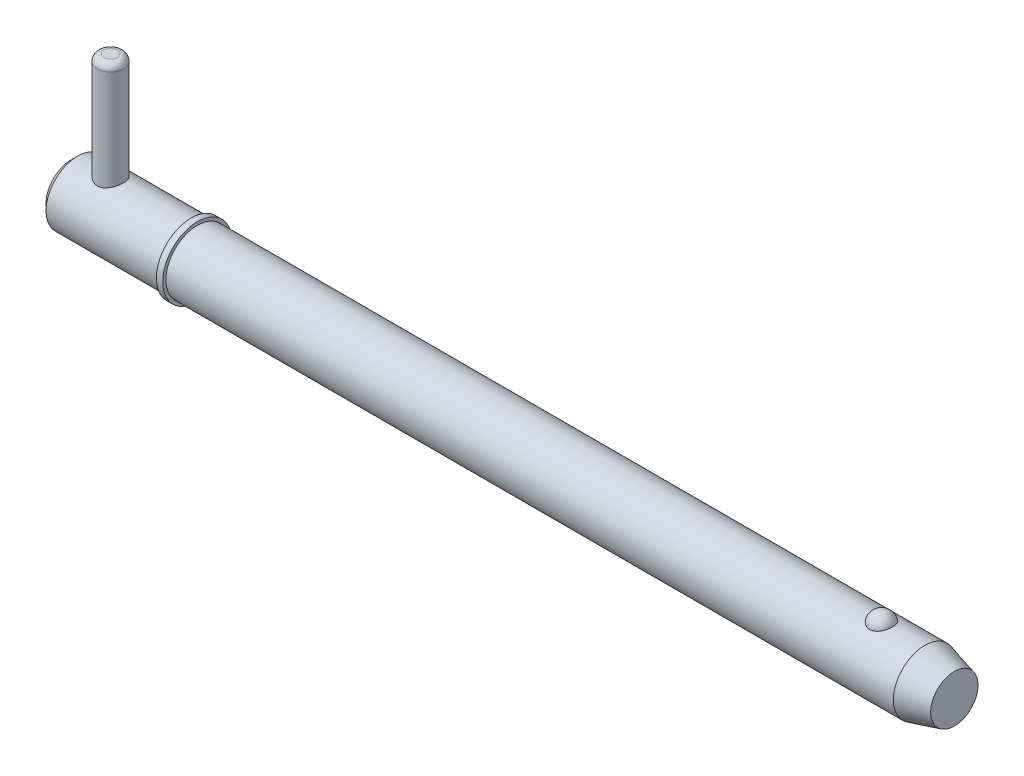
ISO-10303-21;
HEADER;
FILE_DESCRIPTION(('STEP AP214'),'2;1');
FILE_NAME('part.step','',(''),(''),'','','');
FILE_SCHEMA(('AUTOMOTIVE_DESIGN { 1 0 10303 214 1 1 1 1 }'));
ENDSEC;
DATA;
#1=APPLICATION_CONTEXT('core data for automotive mechanical design processes');
#2=APPLICATION_PROTOCOL_DEFINITION('international standard','automotive_design',2000,#1);
#3=PRODUCT_CONTEXT('',#1,'mechanical');
#4=PRODUCT('Part','Part','',(#3));
#5=PRODUCT_RELATED_PRODUCT_CATEGORY('part','',(#4));
#6=PRODUCT_DEFINITION_FORMATION('','',#4);
#7=PRODUCT_DEFINITION_CONTEXT('part definition',#1,'design');
#8=PRODUCT_DEFINITION('design','',#6,#7);
#9=PRODUCT_DEFINITION_SHAPE('','',#8);
#10=(LENGTH_UNIT() NAMED_UNIT(*) SI_UNIT(.MILLI.,.METRE.));
#11=(NAMED_UNIT(*) PLANE_ANGLE_UNIT() SI_UNIT($,.RADIAN.));
#12=(NAMED_UNIT(*) SI_UNIT($,.STERADIAN.) SOLID_ANGLE_UNIT());
#13=UNCERTAINTY_MEASURE_WITH_UNIT(LENGTH_MEASURE(1.E-05),#10,'distance_accuracy_value','');
#14=(GEOMETRIC_REPRESENTATION_CONTEXT(3) GLOBAL_UNCERTAINTY_ASSIGNED_CONTEXT((#13)) GLOBAL_UNIT_ASSIGNED_CONTEXT((#10,
#11,#12)) REPRESENTATION_CONTEXT('',''));
#15=CARTESIAN_POINT('',(0.,0.,0.));
#16=DIRECTION('',(0.,0.,1.));
#17=DIRECTION('',(1.,0.,0.));
#18=AXIS2_PLACEMENT_3D('',#15,#16,#17);
#19=CARTESIAN_POINT('',(5.94,20.635,0.));
#20=DIRECTION('',(0.,-1.,0.));
#21=DIRECTION('',(0.,0.,-1.));
#22=AXIS2_PLACEMENT_3D('',#19,#20,#21);
#23=CYLINDRICAL_SURFACE('',#22,1.98);
#24=CARTESIAN_POINT('',(5.94,-3.775,0.));
#25=DIRECTION('',(0.,1.,0.));
#26=DIRECTION('',(0.,0.,1.));
#27=AXIS2_PLACEMENT_3D('',#24,#25,#26);
#28=CIRCLE('',#27,1.98);
#29=CARTESIAN_POINT('',(5.94,-3.775,1.98));
#30=VERTEX_POINT('',#29);
#31=EDGE_CURVE('P0_E25',#30,#30,#28,.T.);
#32=ORIENTED_EDGE('',*,*,#31,.T.);
#33=EDGE_LOOP('',(#32));
#34=FACE_BOUND('',#33,.T.);
#35=CARTESIAN_POINT('',(5.94,19.645,0.));
#36=DIRECTION('',(0.,1.,0.));
#37=DIRECTION('',(0.,0.,1.));
#38=AXIS2_PLACEMENT_3D('',#35,#36,#37);
#39=CIRCLE('',#38,1.98);
#40=CARTESIAN_POINT('',(5.94,19.645,1.98));
#41=VERTEX_POINT('',#40);
#42=EDGE_CURVE('P0_E29',#41,#41,#39,.F.);
#43=ORIENTED_EDGE('',*,*,#42,.T.);
#44=EDGE_LOOP('',(#43));
#45=FACE_BOUND('',#44,.T.);
#46=ADVANCED_FACE('P0_F14',(#34,#45),#23,.T.);
#47=CARTESIAN_POINT('',(5.94,20.635,0.));
#48=DIRECTION('',(0.,1.,0.));
#49=DIRECTION('',(0.,0.,1.));
#50=AXIS2_PLACEMENT_3D('',#47,#48,#49);
#51=PLANE('',#50);
#52=CARTESIAN_POINT('',(5.94,20.635,0.));
#53=DIRECTION('',(0.,1.,0.));
#54=DIRECTION('',(0.,0.,1.));
#55=AXIS2_PLACEMENT_3D('',#52,#53,#54);
#56=CIRCLE('',#55,0.99);
#57=CARTESIAN_POINT('',(5.94,20.635,0.99));
#58=VERTEX_POINT('',#57);
#59=EDGE_CURVE('P0_E10',#58,#58,#56,.T.);
#60=ORIENTED_EDGE('',*,*,#59,.T.);
#61=EDGE_LOOP('',(#60));
#62=FACE_BOUND('',#61,.T.);
#63=ADVANCED_FACE('P0_F46',(#62),#51,.T.);
#64=CARTESIAN_POINT('',(5.94,-4.765,0.));
#65=DIRECTION('',(0.,1.,0.));
#66=DIRECTION('',(0.,0.,1.));
#67=AXIS2_PLACEMENT_3D('',#64,#65,#66);
#68=PLANE('',#67);
#69=CARTESIAN_POINT('',(5.94,-4.765,0.));
#70=DIRECTION('',(0.,1.,0.));
#71=DIRECTION('',(0.,0.,1.));
#72=AXIS2_PLACEMENT_3D('',#69,#70,#71);
#73=CIRCLE('',#72,0.99);
#74=CARTESIAN_POINT('',(5.94,-4.765,0.99));
#75=VERTEX_POINT('',#74);
#76=EDGE_CURVE('P0_E21',#75,#75,#73,.F.);
#77=ORIENTED_EDGE('',*,*,#76,.T.);
#78=EDGE_LOOP('',(#77));
#79=FACE_BOUND('',#78,.T.);
#80=ADVANCED_FACE('P0_F43',(#79),#68,.F.);
#81=CARTESIAN_POINT('',(5.94,-3.775,0.));
#82=DIRECTION('',(0.,1.,0.));
#83=DIRECTION('',(0.,0.,1.));
#84=AXIS2_PLACEMENT_3D('',#81,#82,#83);
#85=DEGENERATE_TOROIDAL_SURFACE('',#84,0.99,0.99,.T.);
#86=ORIENTED_EDGE('',*,*,#76,.F.);
#87=EDGE_LOOP('',(#86));
#88=FACE_BOUND('',#87,.T.);
#89=ORIENTED_EDGE('',*,*,#31,.F.);
#90=EDGE_LOOP('',(#89));
#91=FACE_BOUND('',#90,.T.);
#92=ADVANCED_FACE('P0_F38',(#88,#91),#85,.T.);
#93=CARTESIAN_POINT('',(5.94,19.645,0.));
#94=DIRECTION('',(0.,1.,0.));
#95=DIRECTION('',(0.,0.,1.));
#96=AXIS2_PLACEMENT_3D('',#93,#94,#95);
#97=DEGENERATE_TOROIDAL_SURFACE('',#96,0.99,0.99,.T.);
#98=ORIENTED_EDGE('',*,*,#42,.F.);
#99=EDGE_LOOP('',(#98));
#100=FACE_BOUND('',#99,.T.);
#101=ORIENTED_EDGE('',*,*,#59,.F.);
#102=EDGE_LOOP('',(#101));
#103=FACE_BOUND('',#102,.T.);
#104=ADVANCED_FACE('P0_F16',(#100,#103),#97,.T.);
#105=CLOSED_SHELL('',(#46,#63,#80,#92,#104));
#106=MANIFOLD_SOLID_BREP('P0_B1',#105);
#107=CARTESIAN_POINT('',(0.,0.,0.));
#108=DIRECTION('',(1.,0.,0.));
#109=DIRECTION('',(0.,0.,-1.));
#110=AXIS2_PLACEMENT_3D('',#107,#108,#109);
#111=CYLINDRICAL_SURFACE('',#110,4.765);
#112=CARTESIAN_POINT('',(128.904194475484,0.,0.));
#113=DIRECTION('',(1.,0.,0.));
#114=DIRECTION('',(0.,0.,-1.));
#115=AXIS2_PLACEMENT_3D('',#112,#113,#114);
#116=CIRCLE('',#115,4.765);
#117=CARTESIAN_POINT('',(128.904194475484,0.,-4.765));
#118=VERTEX_POINT('',#117);
#119=EDGE_CURVE('P1_E81',#118,#118,#116,.T.);
#120=ORIENTED_EDGE('',*,*,#119,.F.);
#121=EDGE_LOOP('',(#120));
#122=FACE_BOUND('',#121,.T.);
#123=CARTESIAN_POINT('',(19.05,0.,0.));
#124=DIRECTION('',(1.,0.,0.));
#125=DIRECTION('',(0.,0.,-1.));
#126=AXIS2_PLACEMENT_3D('',#123,#124,#125);
#127=CIRCLE('',#126,4.765);
#128=CARTESIAN_POINT('',(19.05,0.,-4.765));
#129=VERTEX_POINT('',#128);
#130=EDGE_CURVE('P1_E85',#129,#129,#127,.T.);
#131=ORIENTED_EDGE('',*,*,#130,.T.);
#132=EDGE_LOOP('',(#131));
#133=FACE_BOUND('',#132,.T.);
#134=CARTESIAN_POINT('',(122.351020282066,4.42764777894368,1.76101111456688));
#135=CARTESIAN_POINT('',(122.259721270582,4.42764470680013,1.76101422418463));
#136=CARTESIAN_POINT('',(122.168446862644,4.43059091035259,1.75366340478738));
#137=CARTESIAN_POINT('',(121.988615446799,4.44201846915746,1.72451180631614));
#138=CARTESIAN_POINT('',(121.900057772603,4.45049845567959,1.70271460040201));
#139=CARTESIAN_POINT('',(121.728257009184,4.47200516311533,1.6453937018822));
#140=CARTESIAN_POINT('',(121.645006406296,4.48502527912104,1.60988994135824));
#141=CARTESIAN_POINT('',(121.485763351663,4.51419542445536,1.52617873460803));
#142=CARTESIAN_POINT('',(121.409772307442,4.53034605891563,1.47796883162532));
#143=CARTESIAN_POINT('',(121.264744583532,4.5645931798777,1.36860494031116));
#144=CARTESIAN_POINT('',(121.195964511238,4.58273170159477,1.30712420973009));
#145=CARTESIAN_POINT('',(121.069342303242,4.61870302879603,1.17370204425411));
#146=CARTESIAN_POINT('',(121.011502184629,4.63653577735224,1.10175868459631));
#147=CARTESIAN_POINT('',(120.905570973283,4.67090140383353,0.945806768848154));
#148=CARTESIAN_POINT('',(120.858030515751,4.68734068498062,0.861402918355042));
#149=CARTESIAN_POINT('',(120.777081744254,4.71628466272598,0.685442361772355));
#150=CARTESIAN_POINT('',(120.743674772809,4.72878898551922,0.593884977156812));
#151=CARTESIAN_POINT('',(120.691287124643,4.74874061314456,0.404781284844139));
#152=CARTESIAN_POINT('',(120.672517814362,4.75611366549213,0.30716844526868));
#153=CARTESIAN_POINT('',(120.650584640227,4.76475393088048,0.109940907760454));
#154=CARTESIAN_POINT('',(120.647420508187,4.76602124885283,0.0103262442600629));
#155=CARTESIAN_POINT('',(120.656740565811,4.76232928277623,-0.187629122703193));
#156=CARTESIAN_POINT('',(120.669158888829,4.7573962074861,-0.285973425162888));
#157=CARTESIAN_POINT('',(120.709280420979,4.74184975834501,-0.479027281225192));
#158=CARTESIAN_POINT('',(120.736983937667,4.7312362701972,-0.573736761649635));
#159=CARTESIAN_POINT('',(120.807158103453,4.70540026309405,-0.756973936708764));
#160=CARTESIAN_POINT('',(120.849646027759,4.69017235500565,-0.845494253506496));
#161=CARTESIAN_POINT('',(120.948520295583,4.6566986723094,-1.01378033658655));
#162=CARTESIAN_POINT('',(121.004907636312,4.63845268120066,-1.09354547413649));
#163=CARTESIAN_POINT('',(121.130552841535,4.60085438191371,-1.24228523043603));
#164=CARTESIAN_POINT('',(121.199843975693,4.58149930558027,-1.31123108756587));
#165=CARTESIAN_POINT('',(121.349606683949,4.54391653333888,-1.43607409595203));
#166=CARTESIAN_POINT('',(121.430077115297,4.52568872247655,-1.49197257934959));
#167=CARTESIAN_POINT('',(121.598150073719,4.49293007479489,-1.58786764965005));
#168=CARTESIAN_POINT('',(121.685544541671,4.47832346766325,-1.62820219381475));
#169=CARTESIAN_POINT('',(121.866553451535,4.45406011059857,-1.69345757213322));
#170=CARTESIAN_POINT('',(121.96016555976,4.44440151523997,-1.71838415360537));
#171=CARTESIAN_POINT('',(122.145893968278,4.43159888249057,-1.75112843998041));
#172=CARTESIAN_POINT('',(122.237849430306,4.42815213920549,-1.75974223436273));
#173=CARTESIAN_POINT('',(122.421965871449,4.427247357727,-1.76201865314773));
#174=CARTESIAN_POINT('',(122.514126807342,4.42978816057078,-1.7556841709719));
#175=CARTESIAN_POINT('',(122.693129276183,4.4403864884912,-1.72869560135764));
#176=CARTESIAN_POINT('',(122.780047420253,4.44827555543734,-1.70847853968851));
#177=CARTESIAN_POINT('',(122.949131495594,4.46852246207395,-1.65479562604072));
#178=CARTESIAN_POINT('',(123.031297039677,4.48088066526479,-1.62132869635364));
#179=CARTESIAN_POINT('',(123.190591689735,4.50907357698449,-1.54120560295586));
#180=CARTESIAN_POINT('',(123.267570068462,4.52497884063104,-1.49427526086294));
#181=CARTESIAN_POINT('',(123.412708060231,4.55845148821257,-1.38881222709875));
#182=CARTESIAN_POINT('',(123.480865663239,4.57601924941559,-1.33027689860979));
#183=CARTESIAN_POINT('',(123.610099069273,4.61196537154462,-1.19991049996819));
#184=CARTESIAN_POINT('',(123.670656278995,4.63034074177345,-1.12756415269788));
#185=CARTESIAN_POINT('',(123.779279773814,4.66513959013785,-0.973612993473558));
#186=CARTESIAN_POINT('',(123.827343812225,4.68156271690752,-0.892006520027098));
#187=CARTESIAN_POINT('',(123.911383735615,4.71130224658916,-0.718892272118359));
#188=CARTESIAN_POINT('',(123.946918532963,4.724501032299,-0.627149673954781));
#189=CARTESIAN_POINT('',(124.002952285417,4.74571823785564,-0.438611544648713));
#190=CARTESIAN_POINT('',(124.023450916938,4.75373654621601,-0.341815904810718));
#191=CARTESIAN_POINT('',(124.049033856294,4.76378905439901,-0.145633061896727));
#192=CARTESIAN_POINT('',(124.054076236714,4.76580697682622,-0.046239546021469));
#193=CARTESIAN_POINT('',(124.048523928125,4.7636057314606,0.152038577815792));
#194=CARTESIAN_POINT('',(124.037929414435,4.75938663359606,0.250923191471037));
#195=CARTESIAN_POINT('',(124.001387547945,4.74516937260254,0.445004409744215));
#196=CARTESIAN_POINT('',(123.975496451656,4.73519238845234,0.54021317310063));
#197=CARTESIAN_POINT('',(123.908927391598,4.71049394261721,0.724662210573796));
#198=CARTESIAN_POINT('',(123.868248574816,4.69577220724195,0.81390214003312));
#199=CARTESIAN_POINT('',(123.772717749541,4.66303767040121,0.984313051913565));
#200=CARTESIAN_POINT('',(123.717804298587,4.64501070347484,1.06544688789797));
#201=CARTESIAN_POINT('',(123.595049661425,4.60764678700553,1.21692673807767));
#202=CARTESIAN_POINT('',(123.527208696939,4.58830985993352,1.2872729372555));
#203=CARTESIAN_POINT('',(123.380548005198,4.55060370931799,1.41479271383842));
#204=CARTESIAN_POINT('',(123.301791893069,4.53222967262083,1.47203785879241));
#205=CARTESIAN_POINT('',(123.134989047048,4.49849576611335,1.57212016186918));
#206=CARTESIAN_POINT('',(123.046941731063,4.48313608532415,1.61495641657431));
#207=CARTESIAN_POINT('',(122.859791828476,4.45676184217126,1.68642657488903));
#208=CARTESIAN_POINT('',(122.760365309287,4.44598302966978,1.71430590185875));
#209=CARTESIAN_POINT('',(122.557621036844,4.43142918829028,1.75159258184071));
#210=CARTESIAN_POINT('',(122.454304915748,4.42765125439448,1.76100759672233));
#211=CARTESIAN_POINT('',(122.351020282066,4.42764777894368,1.76101111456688));
#212=B_SPLINE_CURVE_WITH_KNOTS('',3,(#134,#135,#136,#137,#138,#139,#140,#141,#142,#143,#144,
#145,#146,#147,#148,#149,#150,#151,#152,#153,#154,#155,#156,#157,#158,#159,#160,#161,#162,#163,
#164,#165,#166,#167,#168,#169,#170,#171,#172,#173,#174,#175,#176,#177,#178,#179,#180,#181,#182,
#183,#184,#185,#186,#187,#188,#189,#190,#191,#192,#193,#194,#195,#196,#197,#198,#199,#200,#201,
#202,#203,#204,#205,#206,#207,#208,#209,#210,#211),.UNSPECIFIED.,.T.,.F.,(4,2,2,2,2,2,2,2,2,2,2,
2,2,2,2,2,2,2,2,2,2,2,2,2,2,2,2,2,2,2,2,2,2,2,2,2,2,2,4),(0.,0.273517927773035,
0.546968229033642,0.820022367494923,1.09312934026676,1.37393946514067,1.65480131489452,
1.94820420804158,2.24163496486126,2.53922817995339,2.8368162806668,3.13315071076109,
3.42949110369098,3.72617893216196,4.02288805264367,4.32037303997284,4.61782764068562,
4.90840095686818,5.19886582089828,5.4747485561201,5.75057789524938,6.01809977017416,
6.2856434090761,6.55907787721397,6.83257454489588,7.11962987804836,7.40673679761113,
7.70312663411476,7.99952284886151,8.29672237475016,8.59391856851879,8.89002850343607,
9.18615552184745,9.483582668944,9.78100471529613,10.0767610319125,10.3725358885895,
10.6820893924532,10.991514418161),.UNSPECIFIED.);
#213=CARTESIAN_POINT('',(122.351020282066,4.42764777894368,1.76101111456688));
#214=VERTEX_POINT('',#213);
#215=EDGE_CURVE('P1_E35',#214,#214,#212,.T.);
#216=ORIENTED_EDGE('',*,*,#215,.T.);
#217=EDGE_LOOP('',(#216));
#218=FACE_BOUND('',#217,.T.);
#219=ADVANCED_FACE('P1_F13',(#122,#133,#218),#111,.T.);
#220=CARTESIAN_POINT('',(0.,0.,0.));
#221=DIRECTION('',(-1.,0.,0.));
#222=DIRECTION('',(0.,0.,1.));
#223=AXIS2_PLACEMENT_3D('',#220,#221,#222);
#224=PLANE('',#223);
#225=CARTESIAN_POINT('',(0.,0.,0.));
#226=DIRECTION('',(1.,0.,0.));
#227=DIRECTION('',(0.,0.,-1.));
#228=AXIS2_PLACEMENT_3D('',#225,#226,#227);
#229=CIRCLE('',#228,3.812);
#230=CARTESIAN_POINT('',(0.,0.,-3.812));
#231=VERTEX_POINT('',#230);
#232=EDGE_CURVE('P1_E9',#231,#231,#229,.T.);
#233=ORIENTED_EDGE('',*,*,#232,.F.);
#234=EDGE_LOOP('',(#233));
#235=FACE_BOUND('',#234,.T.);
#236=ADVANCED_FACE('P1_F15',(#235),#224,.T.);
#237=CARTESIAN_POINT('',(0.952999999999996,0.,0.));
#238=DIRECTION('',(1.,0.,0.));
#239=DIRECTION('',(0.,0.,-1.));
#240=AXIS2_PLACEMENT_3D('',#237,#238,#239);
#241=CONICAL_SURFACE('',#240,4.765,0.78539816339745);
#242=ORIENTED_EDGE('',*,*,#232,.T.);
#243=EDGE_LOOP('',(#242));
#244=FACE_BOUND('',#243,.T.);
#245=CARTESIAN_POINT('',(0.952999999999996,0.,0.));
#246=DIRECTION('',(1.,0.,0.));
#247=DIRECTION('',(0.,0.,-1.));
#248=AXIS2_PLACEMENT_3D('',#245,#246,#247);
#249=CIRCLE('',#248,4.765);
#250=CARTESIAN_POINT('',(0.952999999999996,0.,-4.765));
#251=VERTEX_POINT('',#250);
#252=EDGE_CURVE('P1_E26',#251,#251,#249,.T.);
#253=ORIENTED_EDGE('',*,*,#252,.F.);
#254=EDGE_LOOP('',(#253));
#255=FACE_BOUND('',#254,.T.);
#256=ADVANCED_FACE('P1_F77',(#244,#255),#241,.T.);
#257=CARTESIAN_POINT('',(0.,0.,0.));
#258=DIRECTION('',(1.,0.,0.));
#259=DIRECTION('',(0.,0.,-1.));
#260=AXIS2_PLACEMENT_3D('',#257,#258,#259);
#261=CYLINDRICAL_SURFACE('',#260,4.765);
#262=CARTESIAN_POINT('',(5.94,-4.33414639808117,1.98));
#263=CARTESIAN_POINT('',(5.83435484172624,-4.33415447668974,1.97999169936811));
#264=CARTESIAN_POINT('',(5.72854887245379,-4.33806396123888,1.97149330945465));
#265=CARTESIAN_POINT('',(5.51998191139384,-4.35319906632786,1.93783487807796));
#266=CARTESIAN_POINT('',(5.41723000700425,-4.3644446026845,1.91262947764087));
#267=CARTESIAN_POINT('',(5.21817294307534,-4.39274225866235,1.84670269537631));
#268=CARTESIAN_POINT('',(5.12184344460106,-4.40977076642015,1.80604432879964));
#269=CARTESIAN_POINT('',(4.93740039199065,-4.44768106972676,1.71055160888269));
#270=CARTESIAN_POINT('',(4.84928487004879,-4.46856193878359,1.65572066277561));
#271=CARTESIAN_POINT('',(4.67826533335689,-4.51326966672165,1.52981120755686));
#272=CARTESIAN_POINT('',(4.59593118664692,-4.53719608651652,1.45799365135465));
#273=CARTESIAN_POINT('',(4.44405452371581,-4.58448035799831,1.30170177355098));
#274=CARTESIAN_POINT('',(4.37451692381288,-4.60783798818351,1.21722260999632));
#275=CARTESIAN_POINT('',(4.24730683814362,-4.65256187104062,1.03353484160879));
#276=CARTESIAN_POINT('',(4.19027484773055,-4.67379892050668,0.933848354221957));
#277=CARTESIAN_POINT('',(4.0940363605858,-4.7106711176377,0.7252544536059));
#278=CARTESIAN_POINT('',(4.05482199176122,-4.72630873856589,0.61635113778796));
#279=CARTESIAN_POINT('',(3.99739515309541,-4.74951416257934,0.398397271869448));
#280=CARTESIAN_POINT('',(3.97820018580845,-4.7574579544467,0.289646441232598));
#281=CARTESIAN_POINT('',(3.95818309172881,-4.76574596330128,0.0701967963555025));
#282=CARTESIAN_POINT('',(3.95735355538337,-4.76609324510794,-0.0405012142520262));
#283=CARTESIAN_POINT('',(3.9735743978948,-4.75937098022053,-0.253561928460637));
#284=CARTESIAN_POINT('',(3.98954548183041,-4.75274912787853,-0.356023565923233));
#285=CARTESIAN_POINT('',(4.03706504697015,-4.73344665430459,-0.556659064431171));
#286=CARTESIAN_POINT('',(4.06861467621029,-4.72076558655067,-0.654832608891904));
#287=CARTESIAN_POINT('',(4.14677192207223,-4.69032846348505,-0.845904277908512));
#288=CARTESIAN_POINT('',(4.19360181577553,-4.67249797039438,-0.938699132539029));
#289=CARTESIAN_POINT('',(4.30077315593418,-4.63350852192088,-1.11535616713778));
#290=CARTESIAN_POINT('',(4.3611193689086,-4.61234839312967,-1.19921518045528));
#291=CARTESIAN_POINT('',(4.49853487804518,-4.56707259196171,-1.3618711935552));
#292=CARTESIAN_POINT('',(4.57648039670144,-4.5428537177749,-1.43990029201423));
#293=CARTESIAN_POINT('',(4.74440779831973,-4.49530722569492,-1.58211009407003));
#294=CARTESIAN_POINT('',(4.83439425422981,-4.47197995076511,-1.64628551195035));
#295=CARTESIAN_POINT('',(5.02755026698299,-4.42812342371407,-1.76092221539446));
#296=CARTESIAN_POINT('',(5.13105348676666,-4.40770990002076,-1.81086937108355));
#297=CARTESIAN_POINT('',(5.34607555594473,-4.37336901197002,-1.89231211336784));
#298=CARTESIAN_POINT('',(5.45758864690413,-4.3594370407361,-1.92382080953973));
#299=CARTESIAN_POINT('',(5.67777275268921,-4.34077746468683,-1.96554536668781));
#300=CARTESIAN_POINT('',(5.78616167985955,-4.33551319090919,-1.9770057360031));
#301=CARTESIAN_POINT('',(6.00341835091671,-4.33325118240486,-1.98196183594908));
#302=CARTESIAN_POINT('',(6.11228591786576,-4.33625061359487,-1.97546372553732));
#303=CARTESIAN_POINT('',(6.32012423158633,-4.34962383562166,-1.94582288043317));
#304=CARTESIAN_POINT('',(6.41928436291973,-4.35951709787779,-1.92376364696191));
#305=CARTESIAN_POINT('',(6.61241543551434,-4.38495043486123,-1.86506038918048));
#306=CARTESIAN_POINT('',(6.70638516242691,-4.40049182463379,-1.82841296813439));
#307=CARTESIAN_POINT('',(6.89090272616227,-4.43627016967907,-1.73985559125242));
#308=CARTESIAN_POINT('',(6.98113841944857,-4.45667771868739,-1.68736639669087));
#309=CARTESIAN_POINT('',(7.1519532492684,-4.49964530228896,-1.56919282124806));
#310=CARTESIAN_POINT('',(7.232528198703,-4.52220626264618,-1.50350275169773));
#311=CARTESIAN_POINT('',(7.38851617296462,-4.56914071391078,-1.35452895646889));
#312=CARTESIAN_POINT('',(7.46298462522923,-4.5935132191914,-1.27025197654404));
#313=CARTESIAN_POINT('',(7.59689029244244,-4.63962841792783,-1.08983181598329));
#314=CARTESIAN_POINT('',(7.65632644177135,-4.66137092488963,-0.993687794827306));
#315=CARTESIAN_POINT('',(7.75840361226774,-4.69991192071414,-0.791608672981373));
#316=CARTESIAN_POINT('',(7.80100481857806,-4.71669866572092,-0.685651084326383));
#317=CARTESIAN_POINT('',(7.86746997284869,-4.74331408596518,-0.467197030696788));
#318=CARTESIAN_POINT('',(7.8913450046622,-4.75314687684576,-0.354704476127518));
#319=CARTESIAN_POINT('',(7.91828971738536,-4.76427543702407,-0.134819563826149));
#320=CARTESIAN_POINT('',(7.92269147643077,-4.76611762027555,-0.027616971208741));
#321=CARTESIAN_POINT('',(7.91414154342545,-4.76256684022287,0.185959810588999));
#322=CARTESIAN_POINT('',(7.90119286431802,-4.75717513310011,0.292334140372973));
#323=CARTESIAN_POINT('',(7.85926572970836,-4.74004856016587,0.497383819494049));
#324=CARTESIAN_POINT('',(7.83086647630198,-4.72854322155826,0.596198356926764));
#325=CARTESIAN_POINT('',(7.75947503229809,-4.70045111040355,0.787624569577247));
#326=CARTESIAN_POINT('',(7.71648006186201,-4.68386336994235,0.880235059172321));
#327=CARTESIAN_POINT('',(7.6149456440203,-4.64628321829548,1.06122875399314));
#328=CARTESIAN_POINT('',(7.55579211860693,-4.62512577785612,1.14923242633));
#329=CARTESIAN_POINT('',(7.42451813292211,-4.58091700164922,1.31443888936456));
#330=CARTESIAN_POINT('',(7.35239289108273,-4.5578649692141,1.39163767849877));
#331=CARTESIAN_POINT('',(7.19146107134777,-4.51050832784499,1.53847013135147));
#332=CARTESIAN_POINT('',(7.10185635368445,-4.48622440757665,1.60723941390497));
#333=CARTESIAN_POINT('',(6.91164948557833,-4.44076541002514,1.72888900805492));
#334=CARTESIAN_POINT('',(6.81104124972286,-4.41959206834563,1.78176046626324));
#335=CARTESIAN_POINT('',(6.60181953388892,-4.38318936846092,1.86953227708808));
#336=CARTESIAN_POINT('',(6.49325511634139,-4.3679267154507,1.90453365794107));
#337=CARTESIAN_POINT('',(6.32681512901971,-4.35102038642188,1.94268459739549));
#338=CARTESIAN_POINT('',(6.27079191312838,-4.34638447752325,1.953006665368));
#339=CARTESIAN_POINT('',(6.15793999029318,-4.33925923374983,1.96879053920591));
#340=CARTESIAN_POINT('',(6.10111188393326,-4.33676837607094,1.97425579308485));
#341=CARTESIAN_POINT('',(6.00947316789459,-4.33456308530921,1.97908711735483));
#342=CARTESIAN_POINT('',(5.97474528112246,-4.33414374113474,1.98000272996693));
#343=CARTESIAN_POINT('',(5.94,-4.33414639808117,1.98));
#344=B_SPLINE_CURVE_WITH_KNOTS('',3,(#262,#263,#264,#265,#266,#267,#268,#269,#270,#271,#272,
#273,#274,#275,#276,#277,#278,#279,#280,#281,#282,#283,#284,#285,#286,#287,#288,#289,#290,#291,
#292,#293,#294,#295,#296,#297,#298,#299,#300,#301,#302,#303,#304,#305,#306,#307,#308,#309,#310,
#311,#312,#313,#314,#315,#316,#317,#318,#319,#320,#321,#322,#323,#324,#325,#326,#327,#328,#329,
#330,#331,#332,#333,#334,#335,#336,#337,#338,#339,#340,#341,#342,#343),.UNSPECIFIED.,.T.,.F.,(4,
2,2,2,2,2,2,2,2,2,2,2,2,2,2,2,2,2,2,2,2,2,2,2,2,2,2,2,2,2,2,2,2,2,2,2,2,2,2,2,4),(0.,
0.316814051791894,0.634491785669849,0.950887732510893,1.2672076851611,1.60127705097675,
1.93547449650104,2.28407463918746,2.63252061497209,2.96292077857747,3.29318763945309,
3.60346227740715,3.91375978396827,4.22878888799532,4.54392926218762,4.88117914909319,
5.21855748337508,5.56691259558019,5.91501972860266,6.24062939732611,6.56612741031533,
6.87094948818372,7.17584258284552,7.49361276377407,7.81152017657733,8.15513975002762,
8.4987836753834,8.8432355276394,9.18748334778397,9.50777781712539,9.8280166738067,
10.1370037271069,10.4460496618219,10.7690461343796,11.0921619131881,11.4371238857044,
11.7822776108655,12.1254577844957,12.2967183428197,12.4678572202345,12.5720531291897),.UNSPECIFIED.);
#345=CARTESIAN_POINT('',(5.94,-4.33414639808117,1.98));
#346=VERTEX_POINT('',#345);
#347=EDGE_CURVE('P1_E17',#346,#346,#344,.T.);
#348=ORIENTED_EDGE('',*,*,#347,.F.);
#349=EDGE_LOOP('',(#348));
#350=FACE_BOUND('',#349,.T.);
#351=CARTESIAN_POINT('',(5.94,4.33414639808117,1.98));
#352=CARTESIAN_POINT('',(6.04564515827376,4.33415447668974,1.97999169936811));
#353=CARTESIAN_POINT('',(6.15145112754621,4.33806396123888,1.97149330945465));
#354=CARTESIAN_POINT('',(6.36001808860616,4.35319906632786,1.93783487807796));
#355=CARTESIAN_POINT('',(6.46276999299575,4.3644446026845,1.91262947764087));
#356=CARTESIAN_POINT('',(6.66182705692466,4.39274225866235,1.84670269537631));
#357=CARTESIAN_POINT('',(6.75815655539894,4.40977076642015,1.80604432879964));
#358=CARTESIAN_POINT('',(6.94259960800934,4.44768106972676,1.71055160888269));
#359=CARTESIAN_POINT('',(7.03071512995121,4.46856193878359,1.65572066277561));
#360=CARTESIAN_POINT('',(7.20173466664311,4.51326966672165,1.52981120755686));
#361=CARTESIAN_POINT('',(7.28406881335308,4.53719608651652,1.45799365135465));
#362=CARTESIAN_POINT('',(7.43594547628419,4.58448035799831,1.30170177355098));
#363=CARTESIAN_POINT('',(7.50548307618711,4.60783798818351,1.21722260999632));
#364=CARTESIAN_POINT('',(7.63269316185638,4.65256187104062,1.03353484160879));
#365=CARTESIAN_POINT('',(7.68972515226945,4.67379892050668,0.933848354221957));
#366=CARTESIAN_POINT('',(7.7859636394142,4.7106711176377,0.7252544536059));
#367=CARTESIAN_POINT('',(7.82517800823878,4.72630873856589,0.61635113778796));
#368=CARTESIAN_POINT('',(7.88260484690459,4.74951416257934,0.398397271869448));
#369=CARTESIAN_POINT('',(7.90179981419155,4.7574579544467,0.289646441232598));
#370=CARTESIAN_POINT('',(7.92181690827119,4.76574596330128,0.0701967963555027));
#371=CARTESIAN_POINT('',(7.92264644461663,4.76609324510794,-0.040501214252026));
#372=CARTESIAN_POINT('',(7.9064256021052,4.75937098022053,-0.253561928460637));
#373=CARTESIAN_POINT('',(7.89045451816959,4.75274912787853,-0.356023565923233));
#374=CARTESIAN_POINT('',(7.84293495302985,4.73344665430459,-0.55665906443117));
#375=CARTESIAN_POINT('',(7.81138532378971,4.72076558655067,-0.654832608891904));
#376=CARTESIAN_POINT('',(7.73322807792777,4.69032846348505,-0.845904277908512));
#377=CARTESIAN_POINT('',(7.68639818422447,4.67249797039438,-0.938699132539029));
#378=CARTESIAN_POINT('',(7.57922684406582,4.63350852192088,-1.11535616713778));
#379=CARTESIAN_POINT('',(7.5188806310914,4.61234839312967,-1.19921518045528));
#380=CARTESIAN_POINT('',(7.38146512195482,4.56707259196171,-1.3618711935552));
#381=CARTESIAN_POINT('',(7.30351960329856,4.5428537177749,-1.43990029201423));
#382=CARTESIAN_POINT('',(7.13559220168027,4.49530722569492,-1.58211009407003));
#383=CARTESIAN_POINT('',(7.04560574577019,4.47197995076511,-1.64628551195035));
#384=CARTESIAN_POINT('',(6.85244973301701,4.42812342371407,-1.76092221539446));
#385=CARTESIAN_POINT('',(6.74894651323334,4.40770990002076,-1.81086937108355));
#386=CARTESIAN_POINT('',(6.53392444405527,4.37336901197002,-1.89231211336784));
#387=CARTESIAN_POINT('',(6.42241135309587,4.3594370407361,-1.92382080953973));
#388=CARTESIAN_POINT('',(6.20222724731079,4.34077746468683,-1.96554536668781));
#389=CARTESIAN_POINT('',(6.09383832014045,4.33551319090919,-1.9770057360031));
#390=CARTESIAN_POINT('',(5.87658164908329,4.33325118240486,-1.98196183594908));
#391=CARTESIAN_POINT('',(5.76771408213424,4.33625061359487,-1.97546372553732));
#392=CARTESIAN_POINT('',(5.55987576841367,4.34962383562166,-1.94582288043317));
#393=CARTESIAN_POINT('',(5.46071563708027,4.35951709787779,-1.92376364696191));
#394=CARTESIAN_POINT('',(5.26758456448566,4.38495043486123,-1.86506038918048));
#395=CARTESIAN_POINT('',(5.17361483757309,4.40049182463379,-1.82841296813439));
#396=CARTESIAN_POINT('',(4.98909727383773,4.43627016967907,-1.73985559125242));
#397=CARTESIAN_POINT('',(4.89886158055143,4.45667771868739,-1.68736639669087));
#398=CARTESIAN_POINT('',(4.72804675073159,4.49964530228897,-1.56919282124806));
#399=CARTESIAN_POINT('',(4.647471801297,4.52220626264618,-1.50350275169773));
#400=CARTESIAN_POINT('',(4.49148382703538,4.56914071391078,-1.35452895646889));
#401=CARTESIAN_POINT('',(4.41701537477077,4.5935132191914,-1.27025197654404));
#402=CARTESIAN_POINT('',(4.28310970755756,4.63962841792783,-1.08983181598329));
#403=CARTESIAN_POINT('',(4.22367355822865,4.66137092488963,-0.993687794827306));
#404=CARTESIAN_POINT('',(4.12159638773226,4.69991192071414,-0.791608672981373));
#405=CARTESIAN_POINT('',(4.07899518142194,4.71669866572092,-0.685651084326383));
#406=CARTESIAN_POINT('',(4.01253002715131,4.74331408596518,-0.467197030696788));
#407=CARTESIAN_POINT('',(3.98865499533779,4.75314687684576,-0.354704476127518));
#408=CARTESIAN_POINT('',(3.96171028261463,4.76427543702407,-0.134819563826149));
#409=CARTESIAN_POINT('',(3.95730852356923,4.76611762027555,-0.0276169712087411));
#410=CARTESIAN_POINT('',(3.96585845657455,4.76256684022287,0.185959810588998));
#411=CARTESIAN_POINT('',(3.97880713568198,4.75717513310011,0.292334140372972));
#412=CARTESIAN_POINT('',(4.02073427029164,4.74004856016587,0.497383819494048));
#413=CARTESIAN_POINT('',(4.04913352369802,4.72854322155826,0.596198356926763));
#414=CARTESIAN_POINT('',(4.12052496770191,4.70045111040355,0.787624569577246));
#415=CARTESIAN_POINT('',(4.16351993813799,4.68386336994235,0.880235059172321));
#416=CARTESIAN_POINT('',(4.2650543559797,4.64628321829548,1.06122875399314));
#417=CARTESIAN_POINT('',(4.32420788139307,4.62512577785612,1.14923242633));
#418=CARTESIAN_POINT('',(4.45548186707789,4.58091700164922,1.31443888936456));
#419=CARTESIAN_POINT('',(4.52760710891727,4.5578649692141,1.39163767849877));
#420=CARTESIAN_POINT('',(4.68853892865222,4.51050832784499,1.53847013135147));
#421=CARTESIAN_POINT('',(4.77814364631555,4.48622440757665,1.60723941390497));
#422=CARTESIAN_POINT('',(4.96835051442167,4.44076541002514,1.72888900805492));
#423=CARTESIAN_POINT('',(5.06895875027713,4.41959206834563,1.78176046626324));
#424=CARTESIAN_POINT('',(5.27818046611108,4.38318936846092,1.86953227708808));
#425=CARTESIAN_POINT('',(5.38674488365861,4.3679267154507,1.90453365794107));
#426=CARTESIAN_POINT('',(5.55318487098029,4.35102038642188,1.94268459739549));
#427=CARTESIAN_POINT('',(5.60920808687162,4.34638447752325,1.953006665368));
#428=CARTESIAN_POINT('',(5.72206000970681,4.33925923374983,1.96879053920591));
#429=CARTESIAN_POINT('',(5.77888811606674,4.33676837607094,1.97425579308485));
#430=CARTESIAN_POINT('',(5.87052683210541,4.33456308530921,1.97908711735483));
#431=CARTESIAN_POINT('',(5.90525471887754,4.33414374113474,1.98000272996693));
#432=CARTESIAN_POINT('',(5.94,4.33414639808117,1.98));
#433=B_SPLINE_CURVE_WITH_KNOTS('',3,(#351,#352,#353,#354,#355,#356,#357,#358,#359,#360,#361,
#362,#363,#364,#365,#366,#367,#368,#369,#370,#371,#372,#373,#374,#375,#376,#377,#378,#379,#380,
#381,#382,#383,#384,#385,#386,#387,#388,#389,#390,#391,#392,#393,#394,#395,#396,#397,#398,#399,
#400,#401,#402,#403,#404,#405,#406,#407,#408,#409,#410,#411,#412,#413,#414,#415,#416,#417,#418,
#419,#420,#421,#422,#423,#424,#425,#426,#427,#428,#429,#430,#431,#432),.UNSPECIFIED.,.T.,.F.,(4,
2,2,2,2,2,2,2,2,2,2,2,2,2,2,2,2,2,2,2,2,2,2,2,2,2,2,2,2,2,2,2,2,2,2,2,2,2,2,2,4),(0.,
0.316814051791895,0.634491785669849,0.950887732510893,1.2672076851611,1.60127705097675,
1.93547449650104,2.28407463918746,2.63252061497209,2.96292077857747,3.29318763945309,
3.60346227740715,3.91375978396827,4.22878888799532,4.54392926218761,4.88117914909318,
5.21855748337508,5.56691259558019,5.91501972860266,6.24062939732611,6.56612741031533,
6.87094948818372,7.17584258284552,7.49361276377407,7.81152017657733,8.15513975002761,
8.4987836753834,8.84323552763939,9.18748334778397,9.50777781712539,9.8280166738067,
10.1370037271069,10.4460496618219,10.7690461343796,11.0921619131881,11.4371238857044,
11.7822776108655,12.1254577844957,12.2967183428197,12.4678572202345,12.5720531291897),.UNSPECIFIED.);
#434=CARTESIAN_POINT('',(5.94,4.33414639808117,1.98));
#435=VERTEX_POINT('',#434);
#436=EDGE_CURVE('P1_E43',#435,#435,#433,.T.);
#437=ORIENTED_EDGE('',*,*,#436,.F.);
#438=EDGE_LOOP('',(#437));
#439=FACE_BOUND('',#438,.T.);
#440=ORIENTED_EDGE('',*,*,#252,.T.);
#441=EDGE_LOOP('',(#440));
#442=FACE_BOUND('',#441,.T.);
#443=CARTESIAN_POINT('',(18.097,0.,0.));
#444=DIRECTION('',(1.,0.,0.));
#445=DIRECTION('',(0.,0.,-1.));
#446=AXIS2_PLACEMENT_3D('',#443,#444,#445);
#447=CIRCLE('',#446,4.765);
#448=CARTESIAN_POINT('',(18.097,0.,-4.765));
#449=VERTEX_POINT('',#448);
#450=EDGE_CURVE('P1_E31',#449,#449,#447,.T.);
#451=ORIENTED_EDGE('',*,*,#450,.F.);
#452=EDGE_LOOP('',(#451));
#453=FACE_BOUND('',#452,.T.);
#454=ADVANCED_FACE('P1_F103',(#350,#439,#442,#453),#261,.T.);
#455=CARTESIAN_POINT('',(18.097,4.765,0.));
#456=DIRECTION('',(-1.,0.,0.));
#457=DIRECTION('',(0.,0.,1.));
#458=AXIS2_PLACEMENT_3D('',#455,#456,#457);
#459=PLANE('',#458);
#460=ORIENTED_EDGE('',*,*,#450,.T.);
#461=EDGE_LOOP('',(#460));
#462=FACE_BOUND('',#461,.T.);
#463=CARTESIAN_POINT('',(18.097,0.,0.));
#464=DIRECTION('',(1.,0.,0.));
#465=DIRECTION('',(0.,0.,-1.));
#466=AXIS2_PLACEMENT_3D('',#463,#464,#465);
#467=CIRCLE('',#466,5.2415);
#468=CARTESIAN_POINT('',(18.097,0.,-5.2415));
#469=VERTEX_POINT('',#468);
#470=EDGE_CURVE('P1_E91',#469,#469,#467,.T.);
#471=ORIENTED_EDGE('',*,*,#470,.F.);
#472=EDGE_LOOP('',(#471));
#473=FACE_BOUND('',#472,.T.);
#474=ADVANCED_FACE('P1_F100',(#462,#473),#459,.T.);
#475=CARTESIAN_POINT('',(0.,0.,0.));
#476=DIRECTION('',(1.,0.,0.));
#477=DIRECTION('',(0.,0.,-1.));
#478=AXIS2_PLACEMENT_3D('',#475,#476,#477);
#479=CYLINDRICAL_SURFACE('',#478,5.2415);
#480=ORIENTED_EDGE('',*,*,#470,.T.);
#481=EDGE_LOOP('',(#480));
#482=FACE_BOUND('',#481,.T.);
#483=CARTESIAN_POINT('',(19.05,0.,0.));
#484=DIRECTION('',(1.,0.,0.));
#485=DIRECTION('',(0.,0.,-1.));
#486=AXIS2_PLACEMENT_3D('',#483,#484,#485);
#487=CIRCLE('',#486,5.2415);
#488=CARTESIAN_POINT('',(19.05,0.,-5.2415));
#489=VERTEX_POINT('',#488);
#490=EDGE_CURVE('P1_E88',#489,#489,#487,.T.);
#491=ORIENTED_EDGE('',*,*,#490,.F.);
#492=EDGE_LOOP('',(#491));
#493=FACE_BOUND('',#492,.T.);
#494=ADVANCED_FACE('P1_F68',(#482,#493),#479,.T.);
#495=CARTESIAN_POINT('',(19.05,5.2415,0.));
#496=DIRECTION('',(1.,0.,0.));
#497=DIRECTION('',(0.,0.,-1.));
#498=AXIS2_PLACEMENT_3D('',#495,#496,#497);
#499=PLANE('',#498);
#500=ORIENTED_EDGE('',*,*,#490,.T.);
#501=EDGE_LOOP('',(#500));
#502=FACE_BOUND('',#501,.T.);
#503=ORIENTED_EDGE('',*,*,#130,.F.);
#504=EDGE_LOOP('',(#503));
#505=FACE_BOUND('',#504,.T.);
#506=ADVANCED_FACE('P1_F62',(#502,#505),#499,.T.);
#507=CARTESIAN_POINT('',(133.35,0.,0.));
#508=DIRECTION('',(-1.,0.,0.));
#509=DIRECTION('',(0.,0.,1.));
#510=AXIS2_PLACEMENT_3D('',#507,#508,#509);
#511=CONICAL_SURFACE('',#510,3.57375000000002,0.261799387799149);
#512=ORIENTED_EDGE('',*,*,#119,.T.);
#513=EDGE_LOOP('',(#512));
#514=FACE_BOUND('',#513,.T.);
#515=CARTESIAN_POINT('',(133.35,0.,0.));
#516=DIRECTION('',(1.,0.,0.));
#517=DIRECTION('',(0.,0.,-1.));
#518=AXIS2_PLACEMENT_3D('',#515,#516,#517);
#519=CIRCLE('',#518,3.57375000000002);
#520=CARTESIAN_POINT('',(133.35,0.,-3.57375000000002));
#521=VERTEX_POINT('',#520);
#522=EDGE_CURVE('P1_E42',#521,#521,#519,.T.);
#523=ORIENTED_EDGE('',*,*,#522,.F.);
#524=EDGE_LOOP('',(#523));
#525=FACE_BOUND('',#524,.T.);
#526=ADVANCED_FACE('P1_F59',(#514,#525),#511,.T.);
#527=CARTESIAN_POINT('',(133.35,3.57375000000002,0.));
#528=DIRECTION('',(1.,0.,0.));
#529=DIRECTION('',(0.,0.,-1.));
#530=AXIS2_PLACEMENT_3D('',#527,#528,#529);
#531=PLANE('',#530);
#532=ORIENTED_EDGE('',*,*,#522,.T.);
#533=EDGE_LOOP('',(#532));
#534=FACE_BOUND('',#533,.T.);
#535=ADVANCED_FACE('P1_F55',(#534),#531,.T.);
#536=CARTESIAN_POINT('',(122.351020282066,4.2885,0.));
#537=DIRECTION('',(-1.,0.,0.));
#538=DIRECTION('',(0.,1.,0.));
#539=AXIS2_PLACEMENT_3D('',#536,#537,#538);
#540=SPHERICAL_SURFACE('',#539,1.7665);
#541=ORIENTED_EDGE('',*,*,#215,.F.);
#542=EDGE_LOOP('',(#541));
#543=FACE_BOUND('',#542,.T.);
#544=ADVANCED_FACE('P1_F50',(#543),#540,.T.);
#545=CARTESIAN_POINT('',(5.94,-5.2415,0.));
#546=DIRECTION('',(0.,1.,0.));
#547=DIRECTION('',(0.,0.,1.));
#548=AXIS2_PLACEMENT_3D('',#545,#546,#547);
#549=CYLINDRICAL_SURFACE('',#548,1.98);
#550=ORIENTED_EDGE('',*,*,#347,.T.);
#551=EDGE_LOOP('',(#550));
#552=FACE_BOUND('',#551,.T.);
#553=ORIENTED_EDGE('',*,*,#436,.T.);
#554=EDGE_LOOP('',(#553));
#555=FACE_BOUND('',#554,.T.);
#556=ADVANCED_FACE('P1_F54',(#552,#555),#549,.F.);
#557=CLOSED_SHELL('',(#219,#236,#256,#454,#474,#494,#506,#526,#535,#544,#556));
#558=MANIFOLD_SOLID_BREP('P1_B1',#557);
#559=ADVANCED_BREP_SHAPE_REPRESENTATION('',(#18,#106,#558),#14);
#560=SHAPE_DEFINITION_REPRESENTATION(#9,#559);
ENDSEC;
END-ISO-10303-21;
